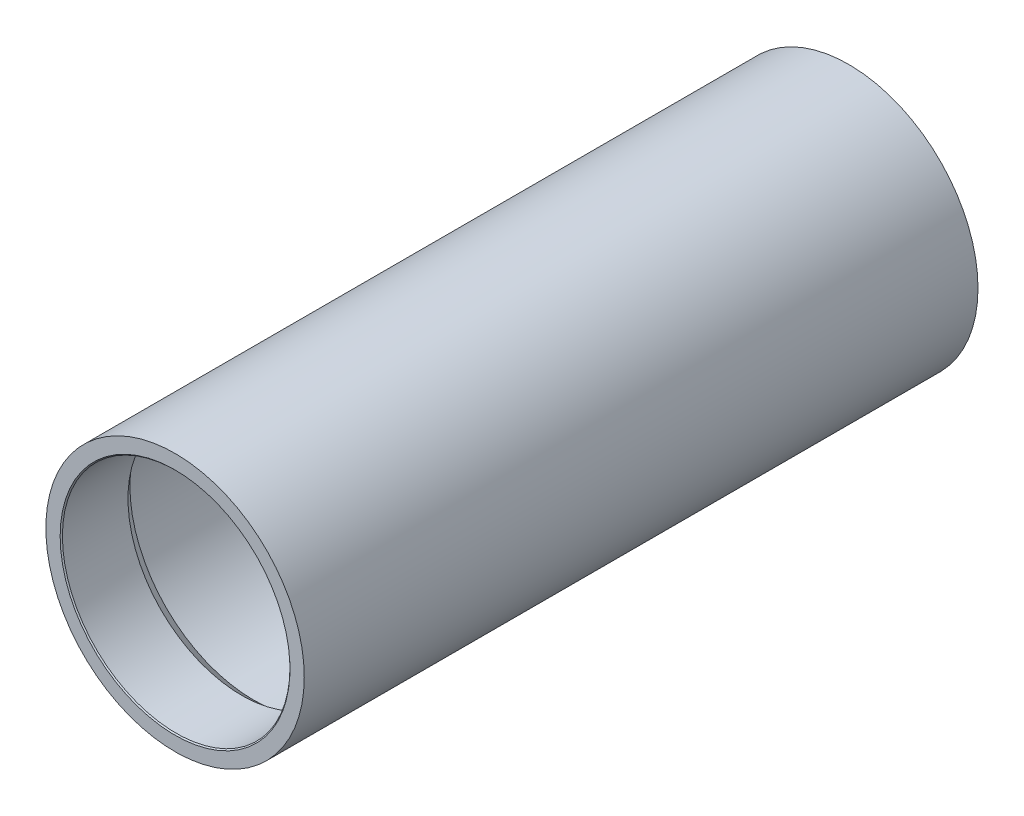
from build123d import *

# Parameters (mm, degrees)
CHAMFER1_SIZE = 0.5


with BuildPart() as part:
    # Sketch1 → Revolve1 (revolve)
    with BuildSketch(Plane(origin=(0, 0, 0), x_dir=(0, 0, -1), z_dir=(1, 0, 0)), mode=Mode.PRIVATE) as revolve1_sk:
        Polygon((0, 57.15), (0, 50.325), (29.5, 50.325), (34.773509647, 54.75), (263.226490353, 54.75), (268.5, 50.325), (298, 50.325), (298, 57.15), align=None)
    revolve(revolve1_sk.sketch.rotate(Axis((0, 0, 0), (0, 0, -1)), 90), axis=Axis((0, 0, 0), (0, 0, -1)))

    # Chamfer1
    chamfer1_edges = [part.edges().sort_by_distance(p)[0] for p in [
        (-50.325, 0, -298),
        (-50.325, 0, 0),
    ]]
    chamfer(chamfer1_edges, length=CHAMFER1_SIZE)


solid = part.part
